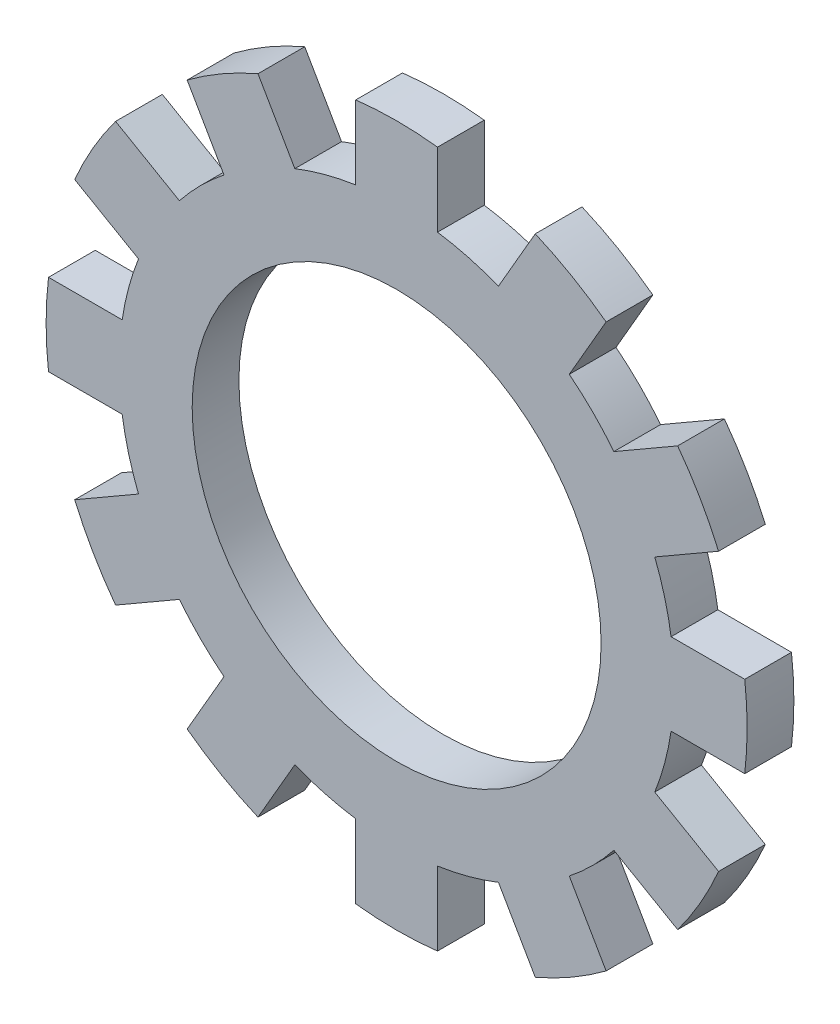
from build123d import *

# Parameters (mm, degrees)
SKETCH1_R                 = 2.375
SKETCH1_R_2               = 1.75
BOSS_EXTRUDE1_DEPTH       = 0.2
BOSS_EXTRUDE2_DEPTH       = 0.2
CIRPATTERN2_COUNT         = 12
CIRPATTERN2_COPY_1_DEPTH  = 0.2
CIRPATTERN2_COPY_2_DEPTH  = 0.2
CIRPATTERN2_COPY_3_DEPTH  = 0.2
CIRPATTERN2_COPY_4_DEPTH  = 0.2
CIRPATTERN2_COPY_5_DEPTH  = 0.2
CIRPATTERN2_COPY_6_DEPTH  = 0.2
CIRPATTERN2_COPY_7_DEPTH  = 0.2
CIRPATTERN2_COPY_8_DEPTH  = 0.2
CIRPATTERN2_COPY_9_DEPTH  = 0.2
CIRPATTERN2_COPY_10_DEPTH = 0.2
CIRPATTERN2_COPY_11_DEPTH = 0.2


with BuildPart() as part:
    # Sketch1 → Boss-Extrude1 (new, symmetric)
    with BuildSketch(Plane.XY):
        Circle(SKETCH1_R)
        Circle(SKETCH1_R_2, mode=Mode.SUBTRACT)
    extrude(amount=BOSS_EXTRUDE1_DEPTH, both=True)

    # Sketch3 → Boss-Extrude2 (add, symmetric)
    with BuildSketch(Plane.XY):
        with BuildLine():
            Line((-0.35, 2.979513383), (-0.35, 2.349068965))
            ThreePointArc((-0.35, 2.349068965), (-0.175479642, 2.368508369), (0, 2.375))
            Line((0, 2.375), (0, 3))
            ThreePointArc((0, 3), (-0.17529953, 2.994873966), (-0.35, 2.979513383))
        make_face()
    boss_extrude2 = extrude(amount=BOSS_EXTRUDE2_DEPTH, both=True)

    # Mirror1: Boss-Extrude2 across plane
    add(boss_extrude2.mirror(Plane(origin=(0, 0, 0), x_dir=(0, 0, 1), z_dir=(1, 0, 0))))

    # CirPattern2: Boss-Extrude2 ×12 about axis
    cirpattern2_axis = Axis((0, 0, 0), (0, 0, 1))
    for i in range(1, CIRPATTERN2_COUNT):
        add(boss_extrude2.rotate(cirpattern2_axis, i * 360 / CIRPATTERN2_COUNT))

    # CirPattern2 copy 1 sketch → CirPattern2 copy 1 (add, symmetric)
    with BuildSketch(Plane(origin=(0, 0, 0), x_dir=(-0.8660254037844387, -0.49999999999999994, 0), z_dir=(0, 0, 1))):
        with BuildLine():
            Line((-0.35, -2.979513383), (-0.35, -2.349068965))
            ThreePointArc((-0.35, -2.349068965), (-0.175479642, -2.368508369), (0, -2.375))
            Line((0, -2.375), (0, -3))
            ThreePointArc((0, -3), (-0.17529953, -2.994873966), (-0.35, -2.979513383))
        make_face()
    extrude(amount=CIRPATTERN2_COPY_1_DEPTH, both=True)

    # CirPattern2 copy 2 sketch → CirPattern2 copy 2 (add, symmetric)
    with BuildSketch(Plane(origin=(0, 0, 0), x_dir=(-0.5000000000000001, -0.8660254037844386, 0), z_dir=(0, 0, 1))):
        with BuildLine():
            Line((-0.35, -2.979513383), (-0.35, -2.349068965))
            ThreePointArc((-0.35, -2.349068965), (-0.175479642, -2.368508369), (0, -2.375))
            Line((0, -2.375), (0, -3))
            ThreePointArc((0, -3), (-0.17529953, -2.994873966), (-0.35, -2.979513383))
        make_face()
    extrude(amount=CIRPATTERN2_COPY_2_DEPTH, both=True)

    # CirPattern2 copy 3 sketch → CirPattern2 copy 3 (add, symmetric)
    with BuildSketch(Plane(origin=(0, 0, 0), x_dir=(0, -1, 0), z_dir=(0, 0, 1))):
        with BuildLine():
            Line((-0.35, -2.979513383), (-0.35, -2.349068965))
            ThreePointArc((-0.35, -2.349068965), (-0.175479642, -2.368508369), (0, -2.375))
            Line((0, -2.375), (0, -3))
            ThreePointArc((0, -3), (-0.17529953, -2.994873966), (-0.35, -2.979513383))
        make_face()
    extrude(amount=CIRPATTERN2_COPY_3_DEPTH, both=True)

    # CirPattern2 copy 4 sketch → CirPattern2 copy 4 (add, symmetric)
    with BuildSketch(Plane(origin=(0, 0, 0), x_dir=(0.4999999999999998, -0.8660254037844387, 0), z_dir=(0, 0, 1))):
        with BuildLine():
            Line((-0.35, -2.979513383), (-0.35, -2.349068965))
            ThreePointArc((-0.35, -2.349068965), (-0.175479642, -2.368508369), (0, -2.375))
            Line((0, -2.375), (0, -3))
            ThreePointArc((0, -3), (-0.17529953, -2.994873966), (-0.35, -2.979513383))
        make_face()
    extrude(amount=CIRPATTERN2_COPY_4_DEPTH, both=True)

    # CirPattern2 copy 5 sketch → CirPattern2 copy 5 (add, symmetric)
    with BuildSketch(Plane(origin=(0, 0, 0), x_dir=(0.8660254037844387, -0.49999999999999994, 0), z_dir=(0, 0, 1))):
        with BuildLine():
            Line((-0.35, -2.979513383), (-0.35, -2.349068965))
            ThreePointArc((-0.35, -2.349068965), (-0.175479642, -2.368508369), (0, -2.375))
            Line((0, -2.375), (0, -3))
            ThreePointArc((0, -3), (-0.17529953, -2.994873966), (-0.35, -2.979513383))
        make_face()
    extrude(amount=CIRPATTERN2_COPY_5_DEPTH, both=True)

    # CirPattern2 copy 6 sketch → CirPattern2 copy 6 (add, symmetric)
    with BuildSketch(Plane.XY):
        with BuildLine():
            Line((-0.35, -2.979513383), (-0.35, -2.349068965))
            ThreePointArc((-0.35, -2.349068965), (-0.175479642, -2.368508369), (0, -2.375))
            Line((0, -2.375), (0, -3))
            ThreePointArc((0, -3), (-0.17529953, -2.994873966), (-0.35, -2.979513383))
        make_face()
    extrude(amount=CIRPATTERN2_COPY_6_DEPTH, both=True)

    # CirPattern2 copy 7 sketch → CirPattern2 copy 7 (add, symmetric)
    with BuildSketch(Plane(origin=(0, 0, 0), x_dir=(0.8660254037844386, 0.5000000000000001, 0), z_dir=(0, 0, 1))):
        with BuildLine():
            Line((-0.35, -2.979513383), (-0.35, -2.349068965))
            ThreePointArc((-0.35, -2.349068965), (-0.175479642, -2.368508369), (0, -2.375))
            Line((0, -2.375), (0, -3))
            ThreePointArc((0, -3), (-0.17529953, -2.994873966), (-0.35, -2.979513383))
        make_face()
    extrude(amount=CIRPATTERN2_COPY_7_DEPTH, both=True)

    # CirPattern2 copy 8 sketch → CirPattern2 copy 8 (add, symmetric)
    with BuildSketch(Plane(origin=(0, 0, 0), x_dir=(0.5000000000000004, 0.8660254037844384, 0), z_dir=(0, 0, 1))):
        with BuildLine():
            Line((-0.35, -2.979513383), (-0.35, -2.349068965))
            ThreePointArc((-0.35, -2.349068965), (-0.175479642, -2.368508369), (0, -2.375))
            Line((0, -2.375), (0, -3))
            ThreePointArc((0, -3), (-0.17529953, -2.994873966), (-0.35, -2.979513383))
        make_face()
    extrude(amount=CIRPATTERN2_COPY_8_DEPTH, both=True)

    # CirPattern2 copy 9 sketch → CirPattern2 copy 9 (add, symmetric)
    with BuildSketch(Plane(origin=(0, 0, 0), x_dir=(0, 1, 0), z_dir=(0, 0, 1))):
        with BuildLine():
            Line((-0.35, -2.979513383), (-0.35, -2.349068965))
            ThreePointArc((-0.35, -2.349068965), (-0.175479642, -2.368508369), (0, -2.375))
            Line((0, -2.375), (0, -3))
            ThreePointArc((0, -3), (-0.17529953, -2.994873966), (-0.35, -2.979513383))
        make_face()
    extrude(amount=CIRPATTERN2_COPY_9_DEPTH, both=True)

    # CirPattern2 copy 10 sketch → CirPattern2 copy 10 (add, symmetric)
    with BuildSketch(Plane(origin=(0, 0, 0), x_dir=(-0.5000000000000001, 0.8660254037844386, 0), z_dir=(0, 0, 1))):
        with BuildLine():
            Line((-0.35, -2.979513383), (-0.35, -2.349068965))
            ThreePointArc((-0.35, -2.349068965), (-0.175479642, -2.368508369), (0, -2.375))
            Line((0, -2.375), (0, -3))
            ThreePointArc((0, -3), (-0.17529953, -2.994873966), (-0.35, -2.979513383))
        make_face()
    extrude(amount=CIRPATTERN2_COPY_10_DEPTH, both=True)

    # CirPattern2 copy 11 sketch → CirPattern2 copy 11 (add, symmetric)
    with BuildSketch(Plane(origin=(0, 0, 0), x_dir=(-0.8660254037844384, 0.5000000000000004, 0), z_dir=(0, 0, 1))):
        with BuildLine():
            Line((-0.35, -2.979513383), (-0.35, -2.349068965))
            ThreePointArc((-0.35, -2.349068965), (-0.175479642, -2.368508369), (0, -2.375))
            Line((0, -2.375), (0, -3))
            ThreePointArc((0, -3), (-0.17529953, -2.994873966), (-0.35, -2.979513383))
        make_face()
    extrude(amount=CIRPATTERN2_COPY_11_DEPTH, both=True)


solid = part.part
